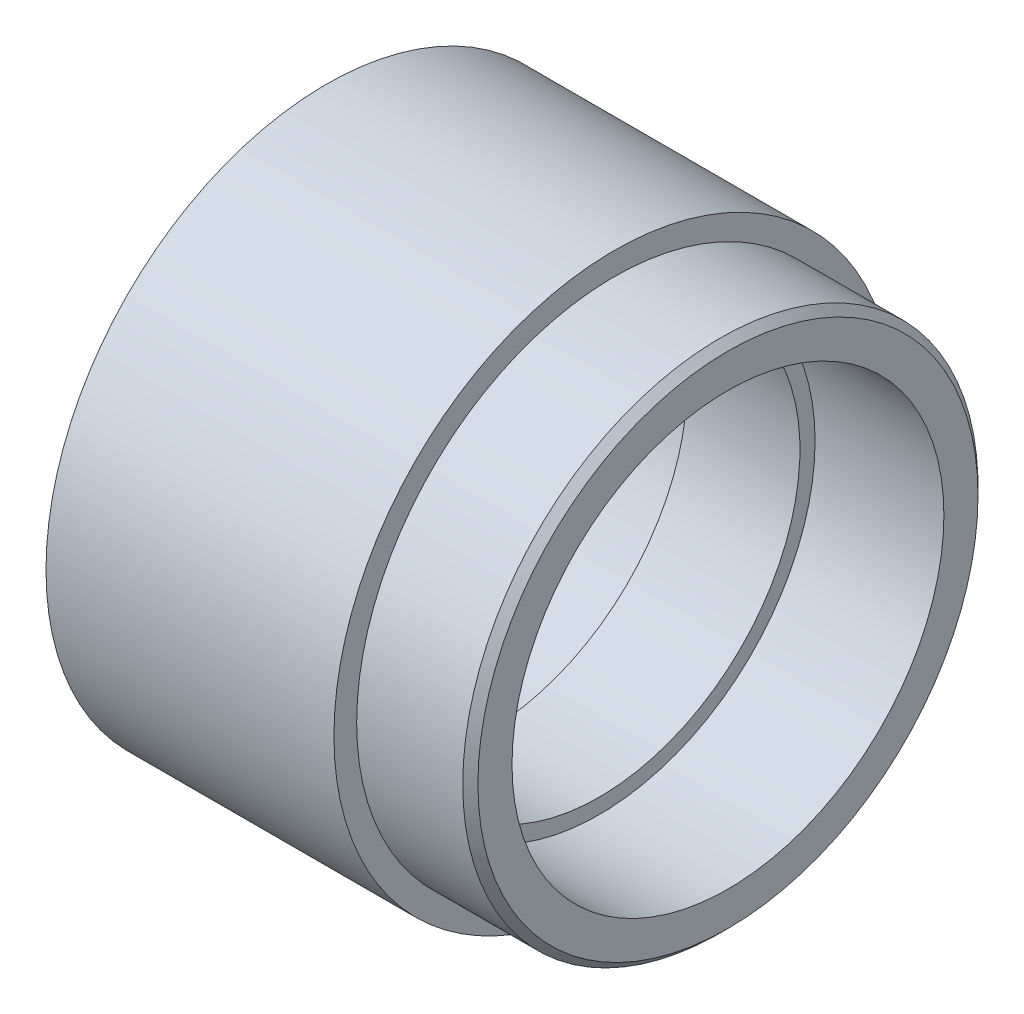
from build123d import *

# Parameters (mm, degrees)
CHANFREIN1_SIZE              = 1
R_P_TITION_CIRCULAIRE1_COUNT = 4


with BuildPart() as part:
    # Esquisse1 → R_volution1 (revolve)
    with BuildSketch(Plane.XY, mode=Mode.PRIVATE) as r_volution1_sk:
        Polygon((11.104537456, 28.5), (32.212133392, 28.5), (32.212133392, 26.5), (47.104537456, 26.5), (47.104537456, 28.5), (64.104537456, 28.5), (64.104537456, 34), (49.104537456, 34), (49.104537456, 37), (11.104537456, 37), align=None)
    revolve(r_volution1_sk.sketch.rotate(Axis((-8.5067659, 0, 0), (1, 0, 0)), 90), axis=Axis((-8.5067659, 0, 0), (1, 0, 0)))

    # Chanfrein1
    chanfrein1_edges = [part.edges().sort_by_distance(p)[0] for p in [
        (11.104537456, 0, -28.5),
        (64.104537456, 0, -34),
    ]]
    chamfer(chanfrein1_edges, length=CHANFREIN1_SIZE)

    # Esquisse2 → Trou taraud_ M4x0.71 (revolve, cut)
    with BuildSketch(Plane(origin=(11.104537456, 32.5, 0), x_dir=(0, 0, 1), z_dir=(0, 1, 0))):
        Polygon((0, 0), (0, 11.091420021), (1.65, 10.1), (1.65, 8), (2, 8), (2, 0), align=None)
    trou_taraud_m4x0_71 = revolve(axis=Axis((4.754537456, 32.5, 0), (1, 0, 0)), mode=Mode.SUBTRACT)

    # R_p_tition circulaire1: Trou taraud_ M4x0.71 ×4 about axis
    r_p_tition_circulaire1_axis = Axis((0, 0, 0), (1, 0, 0))
    for i in range(1, R_P_TITION_CIRCULAIRE1_COUNT):
        add(trou_taraud_m4x0_71.rotate(r_p_tition_circulaire1_axis, i * 360 / R_P_TITION_CIRCULAIRE1_COUNT), mode=Mode.SUBTRACT)


solid = part.part
